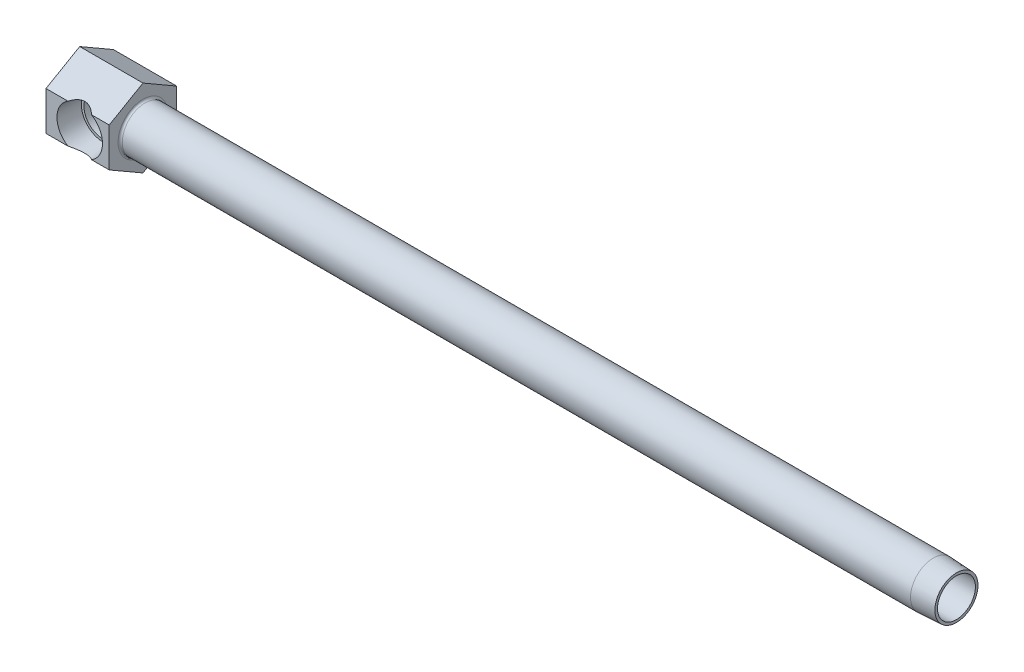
ISO-10303-21;
HEADER;
FILE_DESCRIPTION(('STEP AP214'),'2;1');
FILE_NAME('part.step','',(''),(''),'','','');
FILE_SCHEMA(('AUTOMOTIVE_DESIGN { 1 0 10303 214 1 1 1 1 }'));
ENDSEC;
DATA;
#1=APPLICATION_CONTEXT('core data for automotive mechanical design processes');
#2=APPLICATION_PROTOCOL_DEFINITION('international standard','automotive_design',2000,#1);
#3=PRODUCT_CONTEXT('',#1,'mechanical');
#4=PRODUCT('Part','Part','',(#3));
#5=PRODUCT_RELATED_PRODUCT_CATEGORY('part','',(#4));
#6=PRODUCT_DEFINITION_FORMATION('','',#4);
#7=PRODUCT_DEFINITION_CONTEXT('part definition',#1,'design');
#8=PRODUCT_DEFINITION('design','',#6,#7);
#9=PRODUCT_DEFINITION_SHAPE('','',#8);
#10=(LENGTH_UNIT() NAMED_UNIT(*) SI_UNIT(.MILLI.,.METRE.));
#11=(NAMED_UNIT(*) PLANE_ANGLE_UNIT() SI_UNIT($,.RADIAN.));
#12=(NAMED_UNIT(*) SI_UNIT($,.STERADIAN.) SOLID_ANGLE_UNIT());
#13=UNCERTAINTY_MEASURE_WITH_UNIT(LENGTH_MEASURE(1.E-05),#10,'distance_accuracy_value','');
#14=(GEOMETRIC_REPRESENTATION_CONTEXT(3) GLOBAL_UNCERTAINTY_ASSIGNED_CONTEXT((#13)) GLOBAL_UNIT_ASSIGNED_CONTEXT((#10,
#11,#12)) REPRESENTATION_CONTEXT('',''));
#15=CARTESIAN_POINT('',(0.,0.,0.));
#16=DIRECTION('',(0.,0.,1.));
#17=DIRECTION('',(1.,0.,0.));
#18=AXIS2_PLACEMENT_3D('',#15,#16,#17);
#19=CARTESIAN_POINT('',(63.5,0.,12.7));
#20=DIRECTION('',(-1.,0.,0.));
#21=DIRECTION('',(0.,-1.,0.));
#22=AXIS2_PLACEMENT_3D('',#19,#20,#21);
#23=CYLINDRICAL_SURFACE('',#22,8.5725);
#24=CARTESIAN_POINT('',(24.5999,0.,12.7));
#25=DIRECTION('',(-1.,0.,0.));
#26=DIRECTION('',(0.,-1.,0.));
#27=AXIS2_PLACEMENT_3D('',#24,#25,#26);
#28=CIRCLE('',#27,8.5725);
#29=CARTESIAN_POINT('',(24.5999,-8.57249999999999,12.7));
#30=VERTEX_POINT('',#29);
#31=EDGE_CURVE('E22',#30,#30,#28,.F.);
#32=ORIENTED_EDGE('',*,*,#31,.T.);
#33=EDGE_LOOP('',(#32));
#34=FACE_BOUND('',#33,.T.);
#35=CARTESIAN_POINT('',(321.4624,0.,12.7));
#36=DIRECTION('',(1.,0.,0.));
#37=DIRECTION('',(0.,0.,-1.));
#38=AXIS2_PLACEMENT_3D('',#35,#36,#37);
#39=CIRCLE('',#38,8.5725);
#40=CARTESIAN_POINT('',(321.4624,0.,4.1275));
#41=VERTEX_POINT('',#40);
#42=EDGE_CURVE('E153',#41,#41,#39,.T.);
#43=ORIENTED_EDGE('',*,*,#42,.F.);
#44=EDGE_LOOP('',(#43));
#45=FACE_BOUND('',#44,.T.);
#46=ADVANCED_FACE('F15',(#34,#45),#23,.T.);
#47=CARTESIAN_POINT('',(23.8125,14.6646968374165,12.7));
#48=DIRECTION('',(0.,-0.866025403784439,-0.5));
#49=DIRECTION('',(0.,0.5,-0.866025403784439));
#50=AXIS2_PLACEMENT_3D('',#47,#48,#49);
#51=PLANE('',#50);
#52=CARTESIAN_POINT('',(12.7,-0.84553451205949,39.56450873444));
#53=DIRECTION('',(0.,-0.866025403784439,-0.5));
#54=DIRECTION('',(0.,-0.5,0.866025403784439));
#55=AXIS2_PLACEMENT_3D('',#52,#53,#54);
#56=ELLIPSE('',#55,18.6296608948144,9.27637524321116);
#57=CARTESIAN_POINT('',(17.1412186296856,7.33234841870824,25.4));
#58=VERTEX_POINT('',#57);
#59=CARTESIAN_POINT('',(8.25878137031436,7.33234841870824,25.4));
#60=VERTEX_POINT('',#59);
#61=EDGE_CURVE('E232',#58,#60,#56,.F.);
#62=ORIENTED_EDGE('',*,*,#61,.F.);
#63=DIRECTION('',(-1.,0.,0.));
#64=VECTOR('',#63,1.);
#65=CARTESIAN_POINT('',(23.8125,7.33234841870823,25.4));
#66=LINE('',#65,#64);
#67=CARTESIAN_POINT('',(23.8125,7.33234841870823,25.4));
#68=VERTEX_POINT('',#67);
#69=EDGE_CURVE('E202',#68,#58,#66,.T.);
#70=ORIENTED_EDGE('',*,*,#69,.F.);
#71=DIRECTION('',(0.,-0.5,0.866025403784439));
#72=VECTOR('',#71,1.);
#73=CARTESIAN_POINT('',(23.8125,14.6646968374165,12.7));
#74=LINE('',#73,#72);
#75=CARTESIAN_POINT('',(23.8125,14.6646968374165,12.7));
#76=VERTEX_POINT('',#75);
#77=EDGE_CURVE('E222',#76,#68,#74,.T.);
#78=ORIENTED_EDGE('',*,*,#77,.F.);
#79=DIRECTION('',(-1.,0.,0.));
#80=VECTOR('',#79,1.);
#81=CARTESIAN_POINT('',(23.8125,14.6646968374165,12.7));
#82=LINE('',#81,#80);
#83=CARTESIAN_POINT('',(0.,14.6646968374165,12.7));
#84=VERTEX_POINT('',#83);
#85=EDGE_CURVE('E199',#76,#84,#82,.T.);
#86=ORIENTED_EDGE('',*,*,#85,.T.);
#87=DIRECTION('',(0.,-0.5,0.866025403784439));
#88=VECTOR('',#87,1.);
#89=CARTESIAN_POINT('',(0.,14.6646968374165,12.7));
#90=LINE('',#89,#88);
#91=CARTESIAN_POINT('',(0.,7.33234841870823,25.4));
#92=VERTEX_POINT('',#91);
#93=EDGE_CURVE('E239',#84,#92,#90,.T.);
#94=ORIENTED_EDGE('',*,*,#93,.T.);
#95=EDGE_CURVE('E205',#60,#92,#66,.T.);
#96=ORIENTED_EDGE('',*,*,#95,.F.);
#97=EDGE_LOOP('',(#62,#70,#78,#86,#94,#96));
#98=FACE_BOUND('',#97,.T.);
#99=ADVANCED_FACE('F173',(#98),#51,.F.);
#100=CARTESIAN_POINT('',(23.8125,7.33234841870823,25.4));
#101=DIRECTION('',(0.,0.,-1.));
#102=DIRECTION('',(-1.,0.,0.));
#103=AXIS2_PLACEMENT_3D('',#100,#101,#102);
#104=PLANE('',#103);
#105=CARTESIAN_POINT('',(12.7,0.,25.4));
#106=DIRECTION('',(0.,0.,-1.));
#107=DIRECTION('',(-1.,0.,0.));
#108=AXIS2_PLACEMENT_3D('',#105,#106,#107);
#109=CIRCLE('',#108,8.5725);
#110=CARTESIAN_POINT('',(17.1412186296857,-7.33234841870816,25.4));
#111=VERTEX_POINT('',#110);
#112=EDGE_CURVE('E249',#58,#111,#109,.T.);
#113=ORIENTED_EDGE('',*,*,#112,.T.);
#114=DIRECTION('',(-1.,0.,0.));
#115=VECTOR('',#114,1.);
#116=CARTESIAN_POINT('',(23.8125,-7.33234841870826,25.4));
#117=LINE('',#116,#115);
#118=CARTESIAN_POINT('',(23.8125,-7.33234841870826,25.4));
#119=VERTEX_POINT('',#118);
#120=EDGE_CURVE('E206',#119,#111,#117,.T.);
#121=ORIENTED_EDGE('',*,*,#120,.F.);
#122=DIRECTION('',(0.,-1.,0.));
#123=VECTOR('',#122,1.);
#124=CARTESIAN_POINT('',(23.8125,7.33234841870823,25.4));
#125=LINE('',#124,#123);
#126=EDGE_CURVE('E220',#68,#119,#125,.T.);
#127=ORIENTED_EDGE('',*,*,#126,.F.);
#128=ORIENTED_EDGE('',*,*,#69,.T.);
#129=EDGE_LOOP('',(#113,#121,#127,#128));
#130=FACE_BOUND('',#129,.T.);
#131=ADVANCED_FACE('F179',(#130),#104,.F.);
#132=CARTESIAN_POINT('',(8.25878137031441,-7.33234841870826,25.4));
#133=VERTEX_POINT('',#132);
#134=EDGE_CURVE('E36',#133,#60,#109,.T.);
#135=ORIENTED_EDGE('',*,*,#134,.T.);
#136=ORIENTED_EDGE('',*,*,#95,.T.);
#137=DIRECTION('',(0.,-1.,0.));
#138=VECTOR('',#137,1.);
#139=CARTESIAN_POINT('',(0.,7.33234841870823,25.4));
#140=LINE('',#139,#138);
#141=CARTESIAN_POINT('',(0.,-7.33234841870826,25.4));
#142=VERTEX_POINT('',#141);
#143=EDGE_CURVE('E235',#92,#142,#140,.T.);
#144=ORIENTED_EDGE('',*,*,#143,.T.);
#145=EDGE_CURVE('E209',#133,#142,#117,.T.);
#146=ORIENTED_EDGE('',*,*,#145,.F.);
#147=EDGE_LOOP('',(#135,#136,#144,#146));
#148=FACE_BOUND('',#147,.T.);
#149=ADVANCED_FACE('F285',(#148),#104,.F.);
#150=CARTESIAN_POINT('',(23.8125,-7.33234841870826,25.4));
#151=DIRECTION('',(0.,0.86602540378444,-0.5));
#152=DIRECTION('',(0.,0.5,0.86602540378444));
#153=AXIS2_PLACEMENT_3D('',#150,#151,#152);
#154=PLANE('',#153);
#155=CARTESIAN_POINT('',(12.7,0.845534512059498,39.5645087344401));
#156=DIRECTION('',(0.,0.86602540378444,-0.5));
#157=DIRECTION('',(0.,0.5,0.86602540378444));
#158=AXIS2_PLACEMENT_3D('',#155,#156,#157);
#159=ELLIPSE('',#158,18.6296608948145,9.27637524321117);
#160=EDGE_CURVE('E10',#133,#111,#159,.F.);
#161=ORIENTED_EDGE('',*,*,#160,.F.);
#162=ORIENTED_EDGE('',*,*,#145,.T.);
#163=DIRECTION('',(0.,-0.5,-0.86602540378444));
#164=VECTOR('',#163,1.);
#165=CARTESIAN_POINT('',(0.,-7.33234841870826,25.4));
#166=LINE('',#165,#164);
#167=CARTESIAN_POINT('',(0.,-14.6646968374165,12.7));
#168=VERTEX_POINT('',#167);
#169=EDGE_CURVE('E218',#142,#168,#166,.T.);
#170=ORIENTED_EDGE('',*,*,#169,.T.);
#171=DIRECTION('',(-1.,0.,0.));
#172=VECTOR('',#171,1.);
#173=CARTESIAN_POINT('',(23.8125,-14.6646968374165,12.7));
#174=LINE('',#173,#172);
#175=CARTESIAN_POINT('',(23.8125,-14.6646968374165,12.7));
#176=VERTEX_POINT('',#175);
#177=EDGE_CURVE('E210',#176,#168,#174,.T.);
#178=ORIENTED_EDGE('',*,*,#177,.F.);
#179=DIRECTION('',(0.,-0.5,-0.86602540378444));
#180=VECTOR('',#179,1.);
#181=CARTESIAN_POINT('',(23.8125,-7.33234841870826,25.4));
#182=LINE('',#181,#180);
#183=EDGE_CURVE('E213',#119,#176,#182,.T.);
#184=ORIENTED_EDGE('',*,*,#183,.F.);
#185=ORIENTED_EDGE('',*,*,#120,.T.);
#186=EDGE_LOOP('',(#161,#162,#170,#178,#184,#185));
#187=FACE_BOUND('',#186,.T.);
#188=ADVANCED_FACE('F281',(#187),#154,.F.);
#189=CARTESIAN_POINT('',(23.8125,-14.6646968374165,12.7));
#190=DIRECTION('',(0.,0.866025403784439,0.5));
#191=DIRECTION('',(0.,-0.5,0.866025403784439));
#192=AXIS2_PLACEMENT_3D('',#189,#190,#191);
#193=PLANE('',#192);
#194=DIRECTION('',(0.,0.5,-0.866025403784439));
#195=VECTOR('',#194,1.);
#196=CARTESIAN_POINT('',(0.,-14.6646968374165,12.7));
#197=LINE('',#196,#195);
#198=CARTESIAN_POINT('',(0.,-7.33234841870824,0.));
#199=VERTEX_POINT('',#198);
#200=EDGE_CURVE('E227',#168,#199,#197,.T.);
#201=ORIENTED_EDGE('',*,*,#200,.T.);
#202=DIRECTION('',(-1.,0.,0.));
#203=VECTOR('',#202,1.);
#204=CARTESIAN_POINT('',(23.8125,-7.33234841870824,0.));
#205=LINE('',#204,#203);
#206=CARTESIAN_POINT('',(23.8125,-7.33234841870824,0.));
#207=VERTEX_POINT('',#206);
#208=EDGE_CURVE('E191',#207,#199,#205,.T.);
#209=ORIENTED_EDGE('',*,*,#208,.F.);
#210=DIRECTION('',(0.,0.5,-0.866025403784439));
#211=VECTOR('',#210,1.);
#212=CARTESIAN_POINT('',(23.8125,-14.6646968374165,12.7));
#213=LINE('',#212,#211);
#214=EDGE_CURVE('E214',#176,#207,#213,.T.);
#215=ORIENTED_EDGE('',*,*,#214,.F.);
#216=ORIENTED_EDGE('',*,*,#177,.T.);
#217=EDGE_LOOP('',(#201,#209,#215,#216));
#218=FACE_BOUND('',#217,.T.);
#219=ADVANCED_FACE('F284',(#218),#193,.F.);
#220=CARTESIAN_POINT('',(23.8125,-7.33234841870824,0.));
#221=DIRECTION('',(0.,0.,1.));
#222=DIRECTION('',(0.,-1.,0.));
#223=AXIS2_PLACEMENT_3D('',#220,#221,#222);
#224=PLANE('',#223);
#225=DIRECTION('',(0.,1.,0.));
#226=VECTOR('',#225,1.);
#227=CARTESIAN_POINT('',(0.,-7.33234841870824,0.));
#228=LINE('',#227,#226);
#229=CARTESIAN_POINT('',(0.,7.33234841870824,0.));
#230=VERTEX_POINT('',#229);
#231=EDGE_CURVE('E231',#199,#230,#228,.T.);
#232=ORIENTED_EDGE('',*,*,#231,.T.);
#233=DIRECTION('',(-1.,0.,0.));
#234=VECTOR('',#233,1.);
#235=CARTESIAN_POINT('',(23.8125,7.33234841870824,0.));
#236=LINE('',#235,#234);
#237=CARTESIAN_POINT('',(23.8125,7.33234841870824,0.));
#238=VERTEX_POINT('',#237);
#239=EDGE_CURVE('E196',#238,#230,#236,.T.);
#240=ORIENTED_EDGE('',*,*,#239,.F.);
#241=DIRECTION('',(0.,1.,0.));
#242=VECTOR('',#241,1.);
#243=CARTESIAN_POINT('',(23.8125,-7.33234841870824,0.));
#244=LINE('',#243,#242);
#245=EDGE_CURVE('E217',#207,#238,#244,.T.);
#246=ORIENTED_EDGE('',*,*,#245,.F.);
#247=ORIENTED_EDGE('',*,*,#208,.T.);
#248=EDGE_LOOP('',(#232,#240,#246,#247));
#249=FACE_BOUND('',#248,.T.);
#250=ADVANCED_FACE('F292',(#249),#224,.F.);
#251=CARTESIAN_POINT('',(23.8125,7.33234841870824,0.));
#252=DIRECTION('',(0.,-0.866025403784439,0.5));
#253=DIRECTION('',(0.,-0.5,-0.866025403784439));
#254=AXIS2_PLACEMENT_3D('',#251,#252,#253);
#255=PLANE('',#254);
#256=DIRECTION('',(0.,0.5,0.866025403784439));
#257=VECTOR('',#256,1.);
#258=CARTESIAN_POINT('',(0.,7.33234841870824,0.));
#259=LINE('',#258,#257);
#260=EDGE_CURVE('E243',#230,#84,#259,.T.);
#261=ORIENTED_EDGE('',*,*,#260,.T.);
#262=ORIENTED_EDGE('',*,*,#85,.F.);
#263=DIRECTION('',(0.,0.5,0.866025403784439));
#264=VECTOR('',#263,1.);
#265=CARTESIAN_POINT('',(23.8125,7.33234841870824,0.));
#266=LINE('',#265,#264);
#267=EDGE_CURVE('E224',#238,#76,#266,.T.);
#268=ORIENTED_EDGE('',*,*,#267,.F.);
#269=ORIENTED_EDGE('',*,*,#239,.T.);
#270=EDGE_LOOP('',(#261,#262,#268,#269));
#271=FACE_BOUND('',#270,.T.);
#272=ADVANCED_FACE('F279',(#271),#255,.F.);
#273=CARTESIAN_POINT('',(23.8125,-21.9970452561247,25.4));
#274=DIRECTION('',(-1.,0.,0.));
#275=DIRECTION('',(0.,-1.,0.));
#276=AXIS2_PLACEMENT_3D('',#273,#274,#275);
#277=PLANE('',#276);
#278=CARTESIAN_POINT('',(23.8125,0.,12.7));
#279=DIRECTION('',(-1.,0.,0.));
#280=DIRECTION('',(0.,-1.,0.));
#281=AXIS2_PLACEMENT_3D('',#278,#279,#280);
#282=CIRCLE('',#281,9.3599);
#283=CARTESIAN_POINT('',(23.8125,-9.35989999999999,12.7));
#284=VERTEX_POINT('',#283);
#285=EDGE_CURVE('E189',#284,#284,#282,.T.);
#286=ORIENTED_EDGE('',*,*,#285,.T.);
#287=EDGE_LOOP('',(#286));
#288=FACE_BOUND('',#287,.T.);
#289=ORIENTED_EDGE('',*,*,#214,.T.);
#290=ORIENTED_EDGE('',*,*,#245,.T.);
#291=ORIENTED_EDGE('',*,*,#267,.T.);
#292=ORIENTED_EDGE('',*,*,#77,.T.);
#293=ORIENTED_EDGE('',*,*,#126,.T.);
#294=ORIENTED_EDGE('',*,*,#183,.T.);
#295=EDGE_LOOP('',(#289,#290,#291,#292,#293,#294));
#296=FACE_BOUND('',#295,.T.);
#297=ADVANCED_FACE('F275',(#288,#296),#277,.F.);
#298=CARTESIAN_POINT('',(0.,-21.9970452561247,25.4));
#299=DIRECTION('',(-1.,0.,0.));
#300=DIRECTION('',(0.,-1.,0.));
#301=AXIS2_PLACEMENT_3D('',#298,#299,#300);
#302=PLANE('',#301);
#303=ORIENTED_EDGE('',*,*,#200,.F.);
#304=ORIENTED_EDGE('',*,*,#169,.F.);
#305=ORIENTED_EDGE('',*,*,#143,.F.);
#306=ORIENTED_EDGE('',*,*,#93,.F.);
#307=ORIENTED_EDGE('',*,*,#260,.F.);
#308=ORIENTED_EDGE('',*,*,#231,.F.);
#309=EDGE_LOOP('',(#303,#304,#305,#306,#307,#308));
#310=FACE_BOUND('',#309,.T.);
#311=ADVANCED_FACE('F272',(#310),#302,.T.);
#312=CARTESIAN_POINT('',(24.5999,0.,12.7));
#313=DIRECTION('',(-1.,0.,0.));
#314=DIRECTION('',(0.,-1.,0.));
#315=AXIS2_PLACEMENT_3D('',#312,#313,#314);
#316=TOROIDAL_SURFACE('',#315,9.3599,0.7874);
#317=ORIENTED_EDGE('',*,*,#31,.F.);
#318=EDGE_LOOP('',(#317));
#319=FACE_BOUND('',#318,.T.);
#320=ORIENTED_EDGE('',*,*,#285,.F.);
#321=EDGE_LOOP('',(#320));
#322=FACE_BOUND('',#321,.T.);
#323=ADVANCED_FACE('F269',(#319,#322),#316,.F.);
#324=CARTESIAN_POINT('',(12.7,0.,25.4));
#325=DIRECTION('',(0.,0.,1.));
#326=DIRECTION('',(1.,0.,0.));
#327=AXIS2_PLACEMENT_3D('',#324,#325,#326);
#328=CONICAL_SURFACE('',#327,8.5725,0.0523598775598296);
#329=CARTESIAN_POINT('',(18.2237788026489,-5.94425228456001,16.6622));
#330=CARTESIAN_POINT('',(18.2916176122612,-5.88732299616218,16.7476009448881));
#331=CARTESIAN_POINT('',(18.3592795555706,-5.82850059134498,16.8318676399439));
#332=CARTESIAN_POINT('',(18.4939968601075,-5.70702027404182,16.9981035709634));
#333=CARTESIAN_POINT('',(18.5610521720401,-5.64436205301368,17.0800726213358));
#334=CARTESIAN_POINT('',(18.761107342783,-5.45038497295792,17.3227058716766));
#335=CARTESIAN_POINT('',(18.8927964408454,-5.31322998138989,17.479846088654));
#336=CARTESIAN_POINT('',(19.1518580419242,-5.0216447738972,17.785397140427));
#337=CARTESIAN_POINT('',(19.2791735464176,-4.8670541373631,17.933703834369));
#338=CARTESIAN_POINT('',(19.5257752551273,-4.5416930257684,18.2184184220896));
#339=CARTESIAN_POINT('',(19.6450670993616,-4.37093412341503,18.35483469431));
#340=CARTESIAN_POINT('',(19.9295445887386,-3.92497659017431,18.6779693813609));
#341=CARTESIAN_POINT('',(20.0885588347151,-3.63961711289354,18.8565618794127));
#342=CARTESIAN_POINT('',(20.3031266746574,-3.18637161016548,19.0960411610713));
#343=CARTESIAN_POINT('',(20.3705741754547,-3.03133869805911,19.1710418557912));
#344=CARTESIAN_POINT('',(20.4965477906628,-2.71316594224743,19.3107517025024));
#345=CARTESIAN_POINT('',(20.5550753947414,-2.55002745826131,19.3754625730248));
#346=CARTESIAN_POINT('',(20.6538405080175,-2.24208944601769,19.4844409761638));
#347=CARTESIAN_POINT('',(20.6955064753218,-2.09831594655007,19.5303217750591));
#348=CARTESIAN_POINT('',(20.7709604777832,-1.80624508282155,19.6132970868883));
#349=CARTESIAN_POINT('',(20.8047499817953,-1.65794856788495,19.6503932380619));
#350=CARTESIAN_POINT('',(20.8638747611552,-1.35762804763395,19.7152415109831));
#351=CARTESIAN_POINT('',(20.8892082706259,-1.20560327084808,19.7429916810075));
#352=CARTESIAN_POINT('',(20.9309344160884,-0.898862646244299,19.7886706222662));
#353=CARTESIAN_POINT('',(20.9473269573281,-0.744146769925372,19.8065992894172));
#354=CARTESIAN_POINT('',(20.9708773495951,-0.43270553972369,19.8323499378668));
#355=CARTESIAN_POINT('',(20.9780075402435,-0.275975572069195,19.8401416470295));
#356=CARTESIAN_POINT('',(20.9827943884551,0.0378027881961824,19.8453730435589));
#357=CARTESIAN_POINT('',(20.9804510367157,0.194851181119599,19.8428127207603));
#358=CARTESIAN_POINT('',(20.9663398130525,0.508011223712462,19.8273884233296));
#359=CARTESIAN_POINT('',(20.9545719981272,0.664122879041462,19.8145245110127));
#360=CARTESIAN_POINT('',(20.9218545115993,0.974205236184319,19.77873224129));
#361=CARTESIAN_POINT('',(20.9009049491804,1.12817596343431,19.755804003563));
#362=CARTESIAN_POINT('',(20.8514678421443,1.42545941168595,19.701637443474));
#363=CARTESIAN_POINT('',(20.8233975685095,1.56892578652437,19.670858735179));
#364=CARTESIAN_POINT('',(20.7597875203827,1.85215468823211,19.6010144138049));
#365=CARTESIAN_POINT('',(20.7242449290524,1.99191579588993,19.5619456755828));
#366=CARTESIAN_POINT('',(20.6072066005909,2.40450989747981,19.4330773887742));
#367=CARTESIAN_POINT('',(20.5152596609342,2.67089071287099,19.3315714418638));
#368=CARTESIAN_POINT('',(20.3408066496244,3.10208873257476,19.1379689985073));
#369=CARTESIAN_POINT('',(20.2643220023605,3.27264094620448,19.0528363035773));
#370=CARTESIAN_POINT('',(20.1020422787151,3.60309741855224,18.8714152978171));
#371=CARTESIAN_POINT('',(20.0162439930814,3.76299797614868,18.7751231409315));
#372=CARTESIAN_POINT('',(19.7465644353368,4.22699236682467,18.4708514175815));
#373=CARTESIAN_POINT('',(19.550728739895,4.51459085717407,18.2478400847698));
#374=CARTESIAN_POINT('',(19.2565333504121,4.89305951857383,17.9071622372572));
#375=CARTESIAN_POINT('',(19.1663785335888,5.00247887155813,17.8020703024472));
#376=CARTESIAN_POINT('',(18.9830153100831,5.21324568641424,17.5865045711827));
#377=CARTESIAN_POINT('',(18.8898069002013,5.31459313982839,17.4760307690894));
#378=CARTESIAN_POINT('',(18.7018932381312,5.50848003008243,17.2510129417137));
#379=CARTESIAN_POINT('',(18.6072061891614,5.60108407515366,17.1365090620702));
#380=CARTESIAN_POINT('',(18.4163909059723,5.77848578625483,16.9028222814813));
#381=CARTESIAN_POINT('',(18.320263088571,5.86328566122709,16.783640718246));
#382=CARTESIAN_POINT('',(18.2237788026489,5.94425228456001,16.6622));
#383=B_SPLINE_CURVE_WITH_KNOTS('',3,(#329,#330,#331,#332,#333,#334,#335,#336,#337,#338,#339,
#340,#341,#342,#343,#344,#345,#346,#347,#348,#349,#350,#351,#352,#353,#354,#355,#356,#357,#358,
#359,#360,#361,#362,#363,#364,#365,#366,#367,#368,#369,#370,#371,#372,#373,#374,#375,#376,#377,
#378,#379,#380,#381,#382),.UNSPECIFIED.,.F.,.F.,(4,2,2,2,2,2,2,2,2,2,2,2,2,2,2,2,2,2,2,2,2,2,2,
2,2,2,4),(0.,0.369050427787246,0.738130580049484,1.47737063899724,2.22407355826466,
2.97024599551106,4.0822255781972,4.63656388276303,5.19080950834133,5.66002823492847,
6.12915938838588,6.59838844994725,7.0676224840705,7.53825460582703,8.00888718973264,
8.47951692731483,8.95014106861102,9.3978219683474,9.8456719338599,10.7406458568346,
11.3560801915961,11.9717272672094,13.2057730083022,13.7350494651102,14.2643264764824,
14.7893227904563,15.3141700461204),.UNSPECIFIED.);
#384=CARTESIAN_POINT('',(18.2239376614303,-5.94411896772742,16.6624));
#385=VERTEX_POINT('',#384);
#386=CARTESIAN_POINT('',(18.2239376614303,5.94411896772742,16.6624));
#387=VERTEX_POINT('',#386);
#388=EDGE_CURVE('E128',#385,#387,#383,.T.);
#389=ORIENTED_EDGE('',*,*,#388,.F.);
#390=CARTESIAN_POINT('',(12.7,0.,16.6624));
#391=DIRECTION('',(0.,0.,-1.));
#392=DIRECTION('',(-1.,0.,0.));
#393=AXIS2_PLACEMENT_3D('',#390,#391,#392);
#394=CIRCLE('',#393,8.1145817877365);
#395=EDGE_CURVE('E251',#385,#387,#394,.T.);
#396=ORIENTED_EDGE('',*,*,#395,.T.);
#397=EDGE_LOOP('',(#389,#396));
#398=FACE_BOUND('',#397,.T.);
#399=ORIENTED_EDGE('',*,*,#61,.T.);
#400=ORIENTED_EDGE('',*,*,#134,.F.);
#401=ORIENTED_EDGE('',*,*,#160,.T.);
#402=ORIENTED_EDGE('',*,*,#112,.F.);
#403=EDGE_LOOP('',(#399,#400,#401,#402));
#404=FACE_BOUND('',#403,.T.);
#405=ADVANCED_FACE('F136',(#398,#404),#328,.F.);
#406=CARTESIAN_POINT('',(20.8145817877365,0.,16.6624));
#407=DIRECTION('',(0.,0.,1.));
#408=DIRECTION('',(1.,0.,0.));
#409=AXIS2_PLACEMENT_3D('',#406,#407,#408);
#410=PLANE('',#409);
#411=DIRECTION('',(1.,0.,0.));
#412=VECTOR('',#411,1.);
#413=CARTESIAN_POINT('',(66.667520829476,-5.94411896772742,16.6624));
#414=LINE('',#413,#412);
#415=CARTESIAN_POINT('',(16.6624,-5.9441189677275,16.6624));
#416=VERTEX_POINT('',#415);
#417=EDGE_CURVE('E123',#416,#385,#414,.T.);
#418=ORIENTED_EDGE('',*,*,#417,.F.);
#419=CARTESIAN_POINT('',(12.7,0.,16.6624));
#420=DIRECTION('',(0.,0.,-1.));
#421=DIRECTION('',(-1.,0.,0.));
#422=AXIS2_PLACEMENT_3D('',#419,#420,#421);
#423=CIRCLE('',#422,7.14375);
#424=CARTESIAN_POINT('',(16.6624,5.9441189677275,16.6624));
#425=VERTEX_POINT('',#424);
#426=EDGE_CURVE('E119',#416,#425,#423,.T.);
#427=ORIENTED_EDGE('',*,*,#426,.T.);
#428=DIRECTION('',(1.,0.,0.));
#429=VECTOR('',#428,1.);
#430=CARTESIAN_POINT('',(66.667520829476,5.94411896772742,16.6624));
#431=LINE('',#430,#429);
#432=EDGE_CURVE('E120',#387,#425,#431,.F.);
#433=ORIENTED_EDGE('',*,*,#432,.F.);
#434=ORIENTED_EDGE('',*,*,#395,.F.);
#435=EDGE_LOOP('',(#418,#427,#433,#434));
#436=FACE_BOUND('',#435,.T.);
#437=ADVANCED_FACE('F262',(#436),#410,.T.);
#438=CARTESIAN_POINT('',(12.7,0.,34.595573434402));
#439=DIRECTION('',(0.,0.,-1.));
#440=DIRECTION('',(-1.,0.,0.));
#441=AXIS2_PLACEMENT_3D('',#438,#439,#440);
#442=CYLINDRICAL_SURFACE('',#441,7.14375);
#443=CARTESIAN_POINT('',(12.7,0.,12.7));
#444=DIRECTION('',(0.707106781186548,0.,-0.707106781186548));
#445=DIRECTION('',(-0.707106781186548,0.,-0.707106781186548));
#446=AXIS2_PLACEMENT_3D('',#443,#444,#445);
#447=ELLIPSE('',#446,10.1027881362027,7.14375);
#448=CARTESIAN_POINT('',(12.7,7.14375,12.7));
#449=VERTEX_POINT('',#448);
#450=EDGE_CURVE('E121',#425,#449,#447,.F.);
#451=ORIENTED_EDGE('',*,*,#450,.F.);
#452=ORIENTED_EDGE('',*,*,#426,.F.);
#453=CARTESIAN_POINT('',(12.7,-7.14375,12.7));
#454=VERTEX_POINT('',#453);
#455=EDGE_CURVE('E108',#454,#416,#447,.F.);
#456=ORIENTED_EDGE('',*,*,#455,.F.);
#457=CARTESIAN_POINT('',(12.7,0.,12.7));
#458=DIRECTION('',(-0.707106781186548,0.,-0.707106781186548));
#459=DIRECTION('',(0.707106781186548,0.,-0.707106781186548));
#460=AXIS2_PLACEMENT_3D('',#457,#458,#459);
#461=ELLIPSE('',#460,10.1027881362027,7.14375);
#462=CARTESIAN_POINT('',(18.1005540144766,-4.67623570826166,7.2994459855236));
#463=VERTEX_POINT('',#462);
#464=EDGE_CURVE('E104',#463,#454,#461,.T.);
#465=ORIENTED_EDGE('',*,*,#464,.F.);
#466=CARTESIAN_POINT('',(12.7,0.,7.2994459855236));
#467=DIRECTION('',(0.,0.,-1.));
#468=DIRECTION('',(-1.,0.,0.));
#469=AXIS2_PLACEMENT_3D('',#466,#467,#468);
#470=CIRCLE('',#469,7.14375);
#471=CARTESIAN_POINT('',(18.1005540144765,4.67623570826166,7.2994459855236));
#472=VERTEX_POINT('',#471);
#473=EDGE_CURVE('E134',#463,#472,#470,.T.);
#474=ORIENTED_EDGE('',*,*,#473,.T.);
#475=EDGE_CURVE('E29',#449,#472,#461,.T.);
#476=ORIENTED_EDGE('',*,*,#475,.F.);
#477=EDGE_LOOP('',(#451,#452,#456,#465,#474,#476));
#478=FACE_BOUND('',#477,.T.);
#479=ADVANCED_FACE('F117',(#478),#442,.F.);
#480=CARTESIAN_POINT('',(12.7,0.,7.2994459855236));
#481=DIRECTION('',(0.,0.,1.));
#482=DIRECTION('',(1.,0.,0.));
#483=AXIS2_PLACEMENT_3D('',#480,#481,#482);
#484=CONICAL_SURFACE('',#483,7.14375,1.0471975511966);
#485=CARTESIAN_POINT('',(18.1008122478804,4.67646667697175,7.29964598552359));
#486=CARTESIAN_POINT('',(18.0182484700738,4.60263120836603,7.23572166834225));
#487=CARTESIAN_POINT('',(17.9383238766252,4.52571856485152,7.17175555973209));
#488=CARTESIAN_POINT('',(17.7848563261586,4.36518020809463,7.0441228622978));
#489=CARTESIAN_POINT('',(17.7113260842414,4.28154172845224,6.98045709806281));
#490=CARTESIAN_POINT('',(17.5726476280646,4.1079855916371,6.8545747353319));
#491=CARTESIAN_POINT('',(17.5074361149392,4.01812452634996,6.79235056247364));
#492=CARTESIAN_POINT('',(17.3859720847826,3.83151153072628,6.66964834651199));
#493=CARTESIAN_POINT('',(17.3297132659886,3.73476451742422,6.60916909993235));
#494=CARTESIAN_POINT('',(17.2264163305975,3.53345239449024,6.49019348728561));
#495=CARTESIAN_POINT('',(17.1794940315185,3.42880893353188,6.43172867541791));
#496=CARTESIAN_POINT('',(17.0960237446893,3.21346156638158,6.31865082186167));
#497=CARTESIAN_POINT('',(17.0594774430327,3.10275667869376,6.26403840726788));
#498=CARTESIAN_POINT('',(16.996254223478,2.87633249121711,6.15970832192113));
#499=CARTESIAN_POINT('',(16.9695794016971,2.76061213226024,6.10999169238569));
#500=CARTESIAN_POINT('',(16.9248366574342,2.52527852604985,6.01627423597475));
#501=CARTESIAN_POINT('',(16.9067703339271,2.40566455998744,5.97227447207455));
#502=CARTESIAN_POINT('',(16.872150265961,2.11917129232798,5.87557836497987));
#503=CARTESIAN_POINT('',(16.8585719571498,1.95102064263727,5.82559588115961));
#504=CARTESIAN_POINT('',(16.8395248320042,1.61106163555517,5.73806695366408));
#505=CARTESIAN_POINT('',(16.834060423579,1.43925134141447,5.70052727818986));
#506=CARTESIAN_POINT('',(16.8272216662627,1.09272483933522,5.63811598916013));
#507=CARTESIAN_POINT('',(16.8258602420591,0.918001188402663,5.61328461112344));
#508=CARTESIAN_POINT('',(16.8244844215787,0.567245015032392,5.576623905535));
#509=CARTESIAN_POINT('',(16.8244696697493,0.391212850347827,5.56479114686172));
#510=CARTESIAN_POINT('',(16.8244315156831,0.0298631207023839,5.55391234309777));
#511=CARTESIAN_POINT('',(16.8244077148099,-0.155475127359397,5.55554105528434));
#512=CARTESIAN_POINT('',(16.8245481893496,-0.525517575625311,5.57319743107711));
#513=CARTESIAN_POINT('',(16.8247125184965,-0.710221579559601,5.58922920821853));
#514=CARTESIAN_POINT('',(16.8272365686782,-1.07761401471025,5.63557061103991));
#515=CARTESIAN_POINT('',(16.8295939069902,-1.26030441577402,5.66586472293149));
#516=CARTESIAN_POINT('',(16.8402108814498,-1.62260116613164,5.74051131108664));
#517=CARTESIAN_POINT('',(16.8484676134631,-1.80220898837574,5.78485686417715));
#518=CARTESIAN_POINT('',(16.8713785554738,-2.09762253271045,5.87004472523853));
#519=CARTESIAN_POINT('',(16.8829850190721,-2.21474934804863,5.90713222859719));
#520=CARTESIAN_POINT('',(16.9127302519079,-2.44618190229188,5.98700326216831));
#521=CARTESIAN_POINT('',(16.9308663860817,-2.56048875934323,6.02978449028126));
#522=CARTESIAN_POINT('',(16.9750927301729,-2.78506409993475,6.12039584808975));
#523=CARTESIAN_POINT('',(17.0011553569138,-2.89534512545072,6.16820809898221));
#524=CARTESIAN_POINT('',(17.0623258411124,-3.11130073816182,6.26827147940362));
#525=CARTESIAN_POINT('',(17.0974329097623,-3.21697572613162,6.3205222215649));
#526=CARTESIAN_POINT('',(17.1773511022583,-3.42340093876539,6.42886299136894));
#527=CARTESIAN_POINT('',(17.2222166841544,-3.52411947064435,6.48497330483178));
#528=CARTESIAN_POINT('',(17.3212699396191,-3.71931545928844,6.59977977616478));
#529=CARTESIAN_POINT('',(17.3754591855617,-3.81379185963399,6.65847636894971));
#530=CARTESIAN_POINT('',(17.4924791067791,-3.99641031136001,6.77768652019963));
#531=CARTESIAN_POINT('',(17.5553313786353,-4.08453566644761,6.83820431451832));
#532=CARTESIAN_POINT('',(17.6884734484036,-4.25426378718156,6.96019752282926));
#533=CARTESIAN_POINT('',(17.758764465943,-4.3358654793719,7.02167309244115));
#534=CARTESIAN_POINT('',(17.8750599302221,-4.46018946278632,7.11938400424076));
#535=CARTESIAN_POINT('',(17.9190095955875,-4.5049692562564,7.15548532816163));
#536=CARTESIAN_POINT('',(18.0086324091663,-4.59230195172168,7.22760435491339));
#537=CARTESIAN_POINT('',(18.0542970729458,-4.6348638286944,7.26362172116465));
#538=CARTESIAN_POINT('',(18.1008122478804,-4.67646667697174,7.29964598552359));
#539=B_SPLINE_CURVE_WITH_KNOTS('',3,(#485,#486,#487,#488,#489,#490,#491,#492,#493,#494,#495,
#496,#497,#498,#499,#500,#501,#502,#503,#504,#505,#506,#507,#508,#509,#510,#511,#512,#513,#514,
#515,#516,#517,#518,#519,#520,#521,#522,#523,#524,#525,#526,#527,#528,#529,#530,#531,#532,#533,
#534,#535,#536,#537,#538),.UNSPECIFIED.,.F.,.F.,(4,2,2,2,2,2,2,2,2,2,2,2,2,2,2,2,2,2,2,2,2,2,2,
2,2,2,4),(0.,0.383734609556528,0.768215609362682,1.14957007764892,1.530654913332,
1.91620690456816,2.30182151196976,2.68751795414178,3.07328600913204,3.60029069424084,
4.12758157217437,4.65653172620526,5.18534222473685,5.74081422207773,6.29644491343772,
6.8514726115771,7.40622727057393,7.77616444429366,8.14595249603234,8.5144681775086,
8.8829517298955,9.25354694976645,9.62420472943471,9.99580384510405,10.3674639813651,
10.5845818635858,10.8007392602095),.UNSPECIFIED.);
#540=EDGE_CURVE('E110',#472,#463,#539,.T.);
#541=ORIENTED_EDGE('',*,*,#540,.F.);
#542=ORIENTED_EDGE('',*,*,#473,.F.);
#543=EDGE_LOOP('',(#541,#542));
#544=FACE_BOUND('',#543,.T.);
#545=CARTESIAN_POINT('',(12.7,0.,3.1750000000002));
#546=VERTEX_POINT('',#545);
#547=VERTEX_LOOP('',#546);
#548=FACE_BOUND('',#547,.T.);
#549=ADVANCED_FACE('F144',(#544,#548),#484,.F.);
#550=CARTESIAN_POINT('',(66.667520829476,0.,12.7));
#551=DIRECTION('',(1.,0.,0.));
#552=DIRECTION('',(0.,0.,-1.));
#553=AXIS2_PLACEMENT_3D('',#550,#551,#552);
#554=CYLINDRICAL_SURFACE('',#553,7.1437499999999);
#555=ORIENTED_EDGE('',*,*,#388,.T.);
#556=ORIENTED_EDGE('',*,*,#432,.T.);
#557=ORIENTED_EDGE('',*,*,#450,.T.);
#558=ORIENTED_EDGE('',*,*,#475,.T.);
#559=ORIENTED_EDGE('',*,*,#540,.T.);
#560=ORIENTED_EDGE('',*,*,#464,.T.);
#561=ORIENTED_EDGE('',*,*,#455,.T.);
#562=ORIENTED_EDGE('',*,*,#417,.T.);
#563=EDGE_LOOP('',(#555,#556,#557,#558,#559,#560,#561,#562));
#564=FACE_BOUND('',#563,.T.);
#565=CARTESIAN_POINT('',(330.2,0.,12.7));
#566=DIRECTION('',(1.,0.,0.));
#567=DIRECTION('',(0.,0.,-1.));
#568=AXIS2_PLACEMENT_3D('',#565,#566,#567);
#569=CIRCLE('',#568,7.1437499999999);
#570=CARTESIAN_POINT('',(330.2,0.,5.5562500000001));
#571=VERTEX_POINT('',#570);
#572=EDGE_CURVE('E159',#571,#571,#569,.T.);
#573=ORIENTED_EDGE('',*,*,#572,.T.);
#574=EDGE_LOOP('',(#573));
#575=FACE_BOUND('',#574,.T.);
#576=ADVANCED_FACE('F106',(#564,#575),#554,.F.);
#577=CARTESIAN_POINT('',(330.2,0.,12.7));
#578=DIRECTION('',(-1.,0.,0.));
#579=DIRECTION('',(0.,0.,1.));
#580=AXIS2_PLACEMENT_3D('',#577,#578,#579);
#581=CONICAL_SURFACE('',#580,8.11458178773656,0.052359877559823);
#582=ORIENTED_EDGE('',*,*,#42,.T.);
#583=EDGE_LOOP('',(#582));
#584=FACE_BOUND('',#583,.T.);
#585=CARTESIAN_POINT('',(330.2,0.,12.7));
#586=DIRECTION('',(1.,0.,0.));
#587=DIRECTION('',(0.,0.,-1.));
#588=AXIS2_PLACEMENT_3D('',#585,#586,#587);
#589=CIRCLE('',#588,8.11458178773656);
#590=CARTESIAN_POINT('',(330.2,0.,4.58541821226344));
#591=VERTEX_POINT('',#590);
#592=EDGE_CURVE('E156',#591,#591,#589,.T.);
#593=ORIENTED_EDGE('',*,*,#592,.F.);
#594=EDGE_LOOP('',(#593));
#595=FACE_BOUND('',#594,.T.);
#596=ADVANCED_FACE('F143',(#584,#595),#581,.T.);
#597=CARTESIAN_POINT('',(330.2,0.,5.5562500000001));
#598=DIRECTION('',(1.,0.,0.));
#599=DIRECTION('',(0.,0.,-1.));
#600=AXIS2_PLACEMENT_3D('',#597,#598,#599);
#601=PLANE('',#600);
#602=ORIENTED_EDGE('',*,*,#592,.T.);
#603=EDGE_LOOP('',(#602));
#604=FACE_BOUND('',#603,.T.);
#605=ORIENTED_EDGE('',*,*,#572,.F.);
#606=EDGE_LOOP('',(#605));
#607=FACE_BOUND('',#606,.T.);
#608=ADVANCED_FACE('F163',(#604,#607),#601,.T.);
#609=CLOSED_SHELL('',(#46,#99,#131,#149,#188,#219,#250,#272,#297,#311,#323,#405,#437,#479,#549,
#576,#596,#608));
#610=MANIFOLD_SOLID_BREP('B1',#609);
#611=ADVANCED_BREP_SHAPE_REPRESENTATION('',(#18,#610),#14);
#612=SHAPE_DEFINITION_REPRESENTATION(#9,#611);
ENDSEC;
END-ISO-10303-21;
